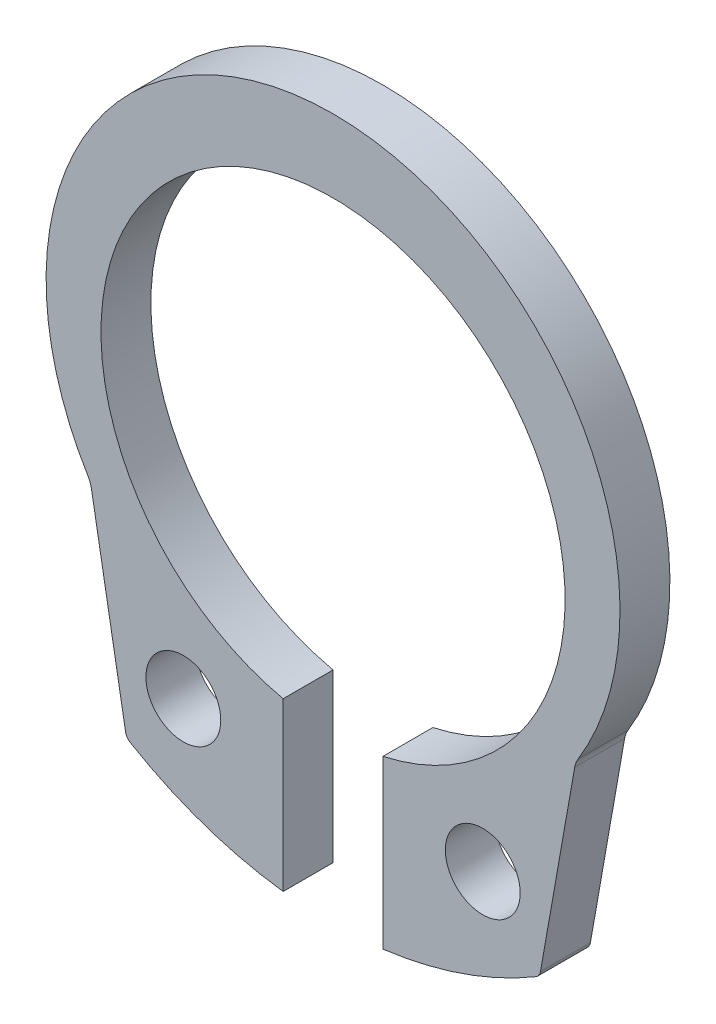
from build123d import *

# Parameters (mm, degrees)
SKETCH1_R  = 0.75
BODY_DEPTH = 1
FILLET1_R  = 0.2
FILLET2_R  = 0.5


with BuildPart() as part:
    # Sketch1 → Body (new body)
    with BuildSketch(Plane.XY):
        with BuildLine():
            Line((-1, -4.901200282), (-1, -8.246856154))
            ThreePointArc((-1, -8.246856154), (-2.628742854, -7.862813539), (-4.141014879, -7.146346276))
            Line((-4.141014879, -7.146346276), (-4.858985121, -3.074534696))
            ThreePointArc((-4.858985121, -3.074534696), (0, 5.75), (4.858985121, -3.074534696))
            Line((4.858985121, -3.074534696), (4.141014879, -7.146346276))
            ThreePointArc((4.141014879, -7.146346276), (2.628742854, -7.862813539), (1, -8.246856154))
            Line((1, -8.246856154), (1, -4.901200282))
            ThreePointArc((1, -4.901200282), (0, 4.29), (-1, -4.901200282))
        make_face()
        with Locations(Location((3, -5.899855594, 0), (0, 0, 180))):
            Circle(SKETCH1_R, mode=Mode.SUBTRACT)
        with Locations((-3, -5.899855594)):
            Circle(SKETCH1_R, mode=Mode.SUBTRACT)
    extrude(amount=-BODY_DEPTH)

    # Fillet1
    fillet1_edges = [part.edges().sort_by_distance(p)[0] for p in [
        (-4.141014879, -7.146346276, -0.5),
        (4.141014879, -7.146346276, -0.5),
    ]]
    fillet(fillet1_edges, radius=FILLET1_R)

    # Fillet2
    fillet2_edges = [part.edges().sort_by_distance(p)[0] for p in [
        (-4.858985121, -3.074534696, -0.5),
        (4.858985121, -3.074534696, -0.5),
    ]]
    fillet(fillet2_edges, radius=FILLET2_R)


solid = part.part
